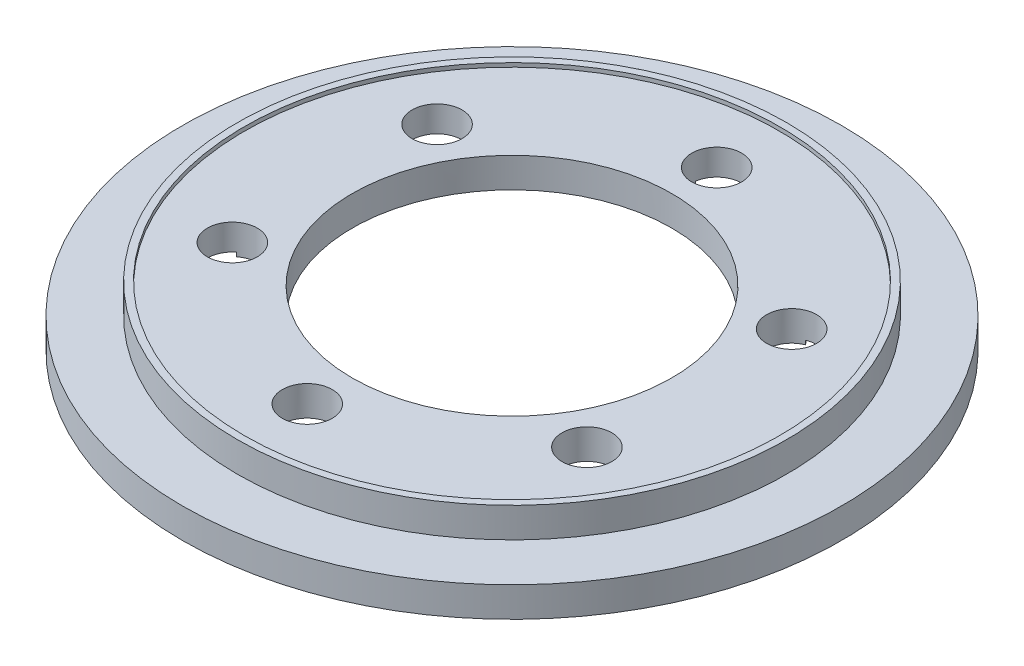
from build123d import *

# Parameters (mm, degrees)
SKETCH1_R           = 16.5
BOSS_EXTRUDE1_DEPTH = 1.5
SKETCH2_R           = 13.75
BOSS_EXTRUDE2_DEPTH = 1.5
SKETCH3_R           = 15.5
CUT_EXTRUDE1_DEPTH  = 1
SKETCH4_R           = 8
CUT_EXTRUDE2_DEPTH  = 24.526580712
SKETCH5_R           = 12.5
CUT_EXTRUDE3_DEPTH  = 0.5
SKETCH7_R           = 13.4
CUT_EXTRUDE5_DEPTH  = 0.2
SKETCH8_R           = 10.5
SKETCH8_R_2         = 8
BOSS_EXTRUDE3_DEPTH = 0.2
SKETCH6_R           = 1.25
CUT_EXTRUDE6_DEPTH  = 24.526580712
CIRPATTERN3_COUNT   = 6


with BuildPart() as part:
    # Sketch1 → Boss-Extrude1 (new body)
    with BuildSketch(Plane(origin=(0, 0, 0), x_dir=(1, 0, 0), z_dir=(0, 1, 0))):
        with Locations(Location((0, 0, 0), (0, 0, 270))):
            Circle(SKETCH1_R)
    extrude(amount=BOSS_EXTRUDE1_DEPTH)

    # Sketch2 → Boss-Extrude2 (add)
    with BuildSketch(Plane(origin=(0, 1.5, 0), x_dir=(1, 0, 0), z_dir=(0, 1, 0))):
        with Locations(Location((0, 0, 0), (0, 0, 270))):
            Circle(SKETCH2_R)
    extrude(amount=BOSS_EXTRUDE2_DEPTH)

    # Sketch3 → Cut-Extrude1 (cut)
    with BuildSketch(Plane.XZ):
        with Locations(Location((0, 0, 0), (0, 0, 270))):
            Circle(SKETCH3_R)
    extrude(amount=-CUT_EXTRUDE1_DEPTH, mode=Mode.SUBTRACT)

    # Sketch4 → Cut-Extrude2 (cut, through all)
    with BuildSketch(Plane(origin=(0, 3, 0), x_dir=(1, 0, 0), z_dir=(0, 1, 0))):
        with Locations(Location((0, 0, 0), (0, 0, 270))):
            Circle(SKETCH4_R)
    extrude(amount=-CUT_EXTRUDE2_DEPTH, mode=Mode.SUBTRACT)

    # Sketch5 → Cut-Extrude3 (cut)
    with BuildSketch(Plane.XZ.offset(-1)):
        with Locations(Location((0, 0, 0), (0, 0, 270))):
            Circle(SKETCH5_R)
    extrude(amount=-CUT_EXTRUDE3_DEPTH, mode=Mode.SUBTRACT)

    # Sketch7 → Cut-Extrude5 (cut)
    with BuildSketch(Plane(origin=(0, 3, 0), x_dir=(1, 0, 0), z_dir=(0, 1, 0))):
        with Locations(Location((0, 0, 0), (0, 0, 270))):
            Circle(SKETCH7_R)
    extrude(amount=-CUT_EXTRUDE5_DEPTH, mode=Mode.SUBTRACT)

    # Sketch8 → Boss-Extrude3 (add)
    with BuildSketch(Plane.XZ.offset(-1.5)):
        with Locations(Location((0, 0, 0), (0, 0, 270))):
            Circle(SKETCH8_R)
        with Locations(Location((0, 0, 0), (0, 0, 90))):
            Circle(SKETCH8_R_2, mode=Mode.SUBTRACT)
    extrude(amount=BOSS_EXTRUDE3_DEPTH)

    # Sketch6 → Cut-Extrude6 (cut, through all)
    with BuildSketch(Plane(origin=(0, 3, 0), x_dir=(1, 0, 0), z_dir=(0, 1, 0))):
        with Locations(Location((0, 10.25, 0), (0, 0, 270))):
            Circle(SKETCH6_R)
    cut_extrude6 = extrude(amount=-CUT_EXTRUDE6_DEPTH, mode=Mode.SUBTRACT)

    # CirPattern3: Cut-Extrude6 ×6 about axis
    cirpattern3_axis = Axis((0, 0, 0), (0, 1, 0))
    for i in range(1, CIRPATTERN3_COUNT):
        add(cut_extrude6.rotate(cirpattern3_axis, i * 360 / CIRPATTERN3_COUNT), mode=Mode.SUBTRACT)


solid = part.part
